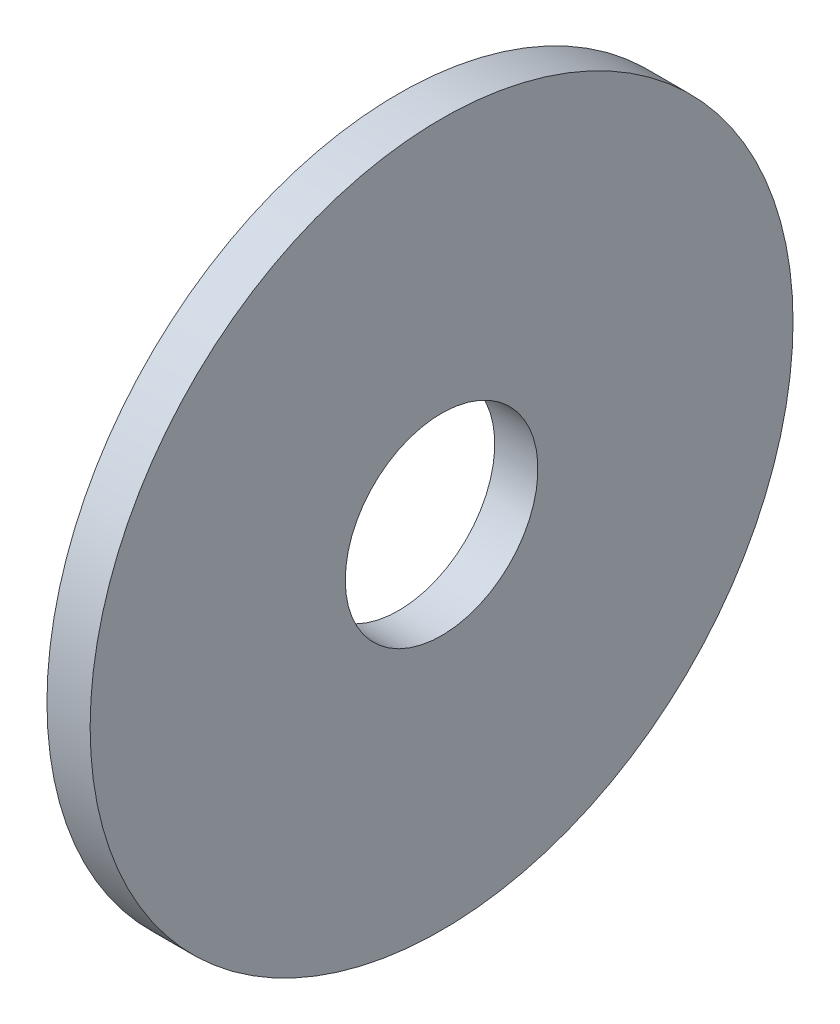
ISO-10303-21;
HEADER;
FILE_DESCRIPTION(('STEP AP214'),'2;1');
FILE_NAME('part.step','',(''),(''),'','','');
FILE_SCHEMA(('AUTOMOTIVE_DESIGN { 1 0 10303 214 1 1 1 1 }'));
ENDSEC;
DATA;
#1=APPLICATION_CONTEXT('core data for automotive mechanical design processes');
#2=APPLICATION_PROTOCOL_DEFINITION('international standard','automotive_design',2000,#1);
#3=PRODUCT_CONTEXT('',#1,'mechanical');
#4=PRODUCT('Part','Part','',(#3));
#5=PRODUCT_RELATED_PRODUCT_CATEGORY('part','',(#4));
#6=PRODUCT_DEFINITION_FORMATION('','',#4);
#7=PRODUCT_DEFINITION_CONTEXT('part definition',#1,'design');
#8=PRODUCT_DEFINITION('design','',#6,#7);
#9=PRODUCT_DEFINITION_SHAPE('','',#8);
#10=(LENGTH_UNIT() NAMED_UNIT(*) SI_UNIT(.MILLI.,.METRE.));
#11=(NAMED_UNIT(*) PLANE_ANGLE_UNIT() SI_UNIT($,.RADIAN.));
#12=(NAMED_UNIT(*) SI_UNIT($,.STERADIAN.) SOLID_ANGLE_UNIT());
#13=UNCERTAINTY_MEASURE_WITH_UNIT(LENGTH_MEASURE(1.E-05),#10,'distance_accuracy_value','');
#14=(GEOMETRIC_REPRESENTATION_CONTEXT(3) GLOBAL_UNCERTAINTY_ASSIGNED_CONTEXT((#13)) GLOBAL_UNIT_ASSIGNED_CONTEXT((#10,
#11,#12)) REPRESENTATION_CONTEXT('',''));
#15=CARTESIAN_POINT('',(0.,0.,0.));
#16=DIRECTION('',(0.,0.,1.));
#17=DIRECTION('',(1.,0.,0.));
#18=AXIS2_PLACEMENT_3D('',#15,#16,#17);
#19=CARTESIAN_POINT('',(-34.9249999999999,0.,0.));
#20=DIRECTION('',(-1.,0.,0.));
#21=DIRECTION('',(0.,0.,1.));
#22=AXIS2_PLACEMENT_3D('',#19,#20,#21);
#23=CYLINDRICAL_SURFACE('',#22,13.4874);
#24=CARTESIAN_POINT('',(0.,0.,0.));
#25=DIRECTION('',(-1.,0.,0.));
#26=DIRECTION('',(0.,0.,1.));
#27=AXIS2_PLACEMENT_3D('',#24,#25,#26);
#28=CIRCLE('',#27,13.4874);
#29=CARTESIAN_POINT('',(0.,0.,13.4874));
#30=VERTEX_POINT('',#29);
#31=EDGE_CURVE('E10',#30,#30,#28,.T.);
#32=ORIENTED_EDGE('',*,*,#31,.F.);
#33=EDGE_LOOP('',(#32));
#34=FACE_BOUND('',#33,.T.);
#35=CARTESIAN_POINT('',(-6.0452,0.,0.));
#36=DIRECTION('',(-1.,0.,0.));
#37=DIRECTION('',(0.,0.,1.));
#38=AXIS2_PLACEMENT_3D('',#35,#36,#37);
#39=CIRCLE('',#38,13.4874);
#40=CARTESIAN_POINT('',(-6.0452,0.,13.4874));
#41=VERTEX_POINT('',#40);
#42=EDGE_CURVE('E45',#41,#41,#39,.T.);
#43=ORIENTED_EDGE('',*,*,#42,.T.);
#44=EDGE_LOOP('',(#43));
#45=FACE_BOUND('',#44,.T.);
#46=ADVANCED_FACE('F31',(#34,#45),#23,.F.);
#47=CARTESIAN_POINT('',(0.,13.4874,0.));
#48=DIRECTION('',(-1.,0.,0.));
#49=DIRECTION('',(0.,0.,1.));
#50=AXIS2_PLACEMENT_3D('',#47,#48,#49);
#51=PLANE('',#50);
#52=CARTESIAN_POINT('',(0.,0.,0.));
#53=DIRECTION('',(-1.,0.,0.));
#54=DIRECTION('',(0.,0.,1.));
#55=AXIS2_PLACEMENT_3D('',#52,#53,#54);
#56=CIRCLE('',#55,49.2125);
#57=CARTESIAN_POINT('',(0.,0.,49.2125));
#58=VERTEX_POINT('',#57);
#59=EDGE_CURVE('E37',#58,#58,#56,.T.);
#60=ORIENTED_EDGE('',*,*,#59,.F.);
#61=EDGE_LOOP('',(#60));
#62=FACE_BOUND('',#61,.T.);
#63=ORIENTED_EDGE('',*,*,#31,.T.);
#64=EDGE_LOOP('',(#63));
#65=FACE_BOUND('',#64,.T.);
#66=ADVANCED_FACE('F60',(#62,#65),#51,.F.);
#67=CARTESIAN_POINT('',(-34.9249999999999,0.,0.));
#68=DIRECTION('',(-1.,0.,0.));
#69=DIRECTION('',(0.,0.,1.));
#70=AXIS2_PLACEMENT_3D('',#67,#68,#69);
#71=CYLINDRICAL_SURFACE('',#70,49.2125);
#72=CARTESIAN_POINT('',(-6.0452,0.,0.));
#73=DIRECTION('',(-1.,0.,0.));
#74=DIRECTION('',(0.,0.,1.));
#75=AXIS2_PLACEMENT_3D('',#72,#73,#74);
#76=CIRCLE('',#75,49.2125);
#77=CARTESIAN_POINT('',(-6.0452,0.,49.2125));
#78=VERTEX_POINT('',#77);
#79=EDGE_CURVE('E41',#78,#78,#76,.T.);
#80=ORIENTED_EDGE('',*,*,#79,.F.);
#81=EDGE_LOOP('',(#80));
#82=FACE_BOUND('',#81,.T.);
#83=ORIENTED_EDGE('',*,*,#59,.T.);
#84=EDGE_LOOP('',(#83));
#85=FACE_BOUND('',#84,.T.);
#86=ADVANCED_FACE('F55',(#82,#85),#71,.T.);
#87=CARTESIAN_POINT('',(-6.0452,49.2125,0.));
#88=DIRECTION('',(1.,0.,0.));
#89=DIRECTION('',(0.,0.,-1.));
#90=AXIS2_PLACEMENT_3D('',#87,#88,#89);
#91=PLANE('',#90);
#92=ORIENTED_EDGE('',*,*,#42,.F.);
#93=EDGE_LOOP('',(#92));
#94=FACE_BOUND('',#93,.T.);
#95=ORIENTED_EDGE('',*,*,#79,.T.);
#96=EDGE_LOOP('',(#95));
#97=FACE_BOUND('',#96,.T.);
#98=ADVANCED_FACE('F52',(#94,#97),#91,.F.);
#99=CLOSED_SHELL('',(#46,#66,#86,#98));
#100=MANIFOLD_SOLID_BREP('B2',#99);
#101=ADVANCED_BREP_SHAPE_REPRESENTATION('',(#18,#100),#14);
#102=SHAPE_DEFINITION_REPRESENTATION(#9,#101);
ENDSEC;
END-ISO-10303-21;
